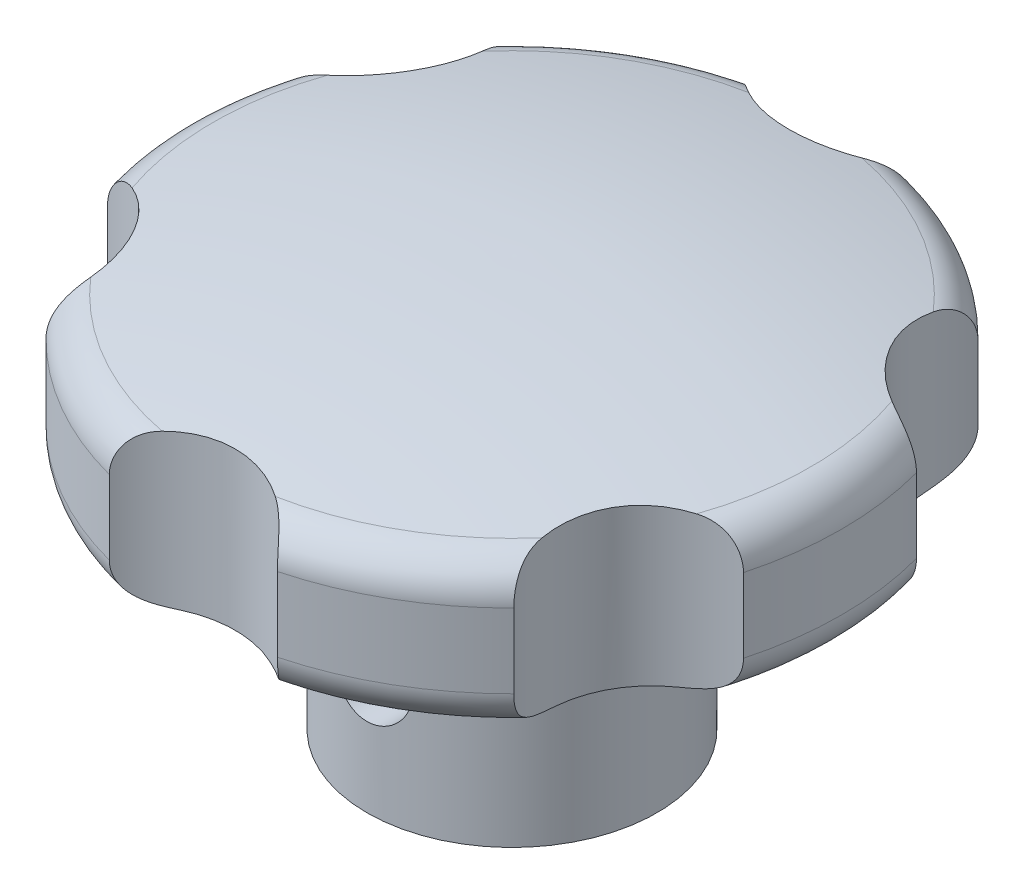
from build123d import *

# Parameters (mm, degrees)
FILLET_1_R               = 3
SKETCH_2_R               = 8
CUT_EXTRUDE_1_DEPTH      = 40.230091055
PATTERN_CIRCULAR_1_COUNT = 6
F_10_0MM_1_D             = 10
F_10_0MM_1_DEPTH         = 18
F_10_0MM_1_TIP           = 3.004303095
SKETCH_8_R               = 3
CUT_EXTRUDE_3_DEPTH      = 11
PATTERN_CIRCULAR_3_COUNT = 2
PATTERN_CIRCULAR_3_ANGLE = 120


with BuildPart() as part:
    # Sketch 1 → Revolve 1 (revolve)
    with BuildSketch(Plane(origin=(0, 0, 0), x_dir=(0, 0, -1), z_dir=(1, 0, 0))):
        with BuildLine():
            Line((0, 0), (11, 0))
            Line((11, 0), (11, 17))
            Line((11, 17), (25, 17))
            Line((25, 17), (25, 28))
            ThreePointArc((25, 28), (12.594799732, 30.289997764), (0, 31))
            Line((0, 31), (0, 0))
        make_face()
    revolve(axis=Axis((0, 0, 0), (0, 1, 0)))

    # Fillet 1
    fillet_1_edges = [part.edges().sort_by_distance(p)[0] for p in [
        (0, 17, 11),
        (0, 17, 25),
        (0, 28, 25),
    ]]
    fillet(fillet_1_edges, radius=FILLET_1_R)

    # Sketch 2 → Cut-Extrude 1 (cut, through all)
    with BuildSketch(Plane.XZ.offset(-17)):
        with Locations((0, 29)):
            Circle(SKETCH_2_R)
    cut_extrude_1 = extrude(amount=-CUT_EXTRUDE_1_DEPTH, mode=Mode.SUBTRACT)

    # Pattern Circular 1: Cut-Extrude 1 ×6 about axis
    pattern_circular_1_axis = Axis((0, 0, 0), (0, 1, 0))
    for i in range(1, PATTERN_CIRCULAR_1_COUNT):
        add(cut_extrude_1.rotate(pattern_circular_1_axis, i * 360 / PATTERN_CIRCULAR_1_COUNT), mode=Mode.SUBTRACT)

    # 10.0mm _1
    with Locations(Plane(origin=(0, 0, 0), x_dir=(-1, 0, 0), z_dir=(0, -1, 0))):
        with Locations((0, 0)):
            Hole(F_10_0MM_1_D / 2, depth=F_10_0MM_1_DEPTH)
            with Locations((0, 0, -(F_10_0MM_1_DEPTH + F_10_0MM_1_TIP / 2))):  # 118° drill point
                Cone(0, F_10_0MM_1_D / 2, F_10_0MM_1_TIP, mode=Mode.SUBTRACT)

    # Sketch 8 → Cut-Extrude 3 (cut)
    with BuildSketch(Plane.XY):
        with Locations(Location((0, 9, 0), (0, 0, 180))):
            Circle(SKETCH_8_R)
    cut_extrude_3 = extrude(amount=CUT_EXTRUDE_3_DEPTH, mode=Mode.SUBTRACT)

    # Pattern Circular 3: Cut-Extrude 3 ×2 about axis
    pattern_circular_3_axis = Axis((0, 0, 0), (0, 1, 0))
    for i in range(1, PATTERN_CIRCULAR_3_COUNT):
        add(cut_extrude_3.rotate(pattern_circular_3_axis, i * PATTERN_CIRCULAR_3_ANGLE / (PATTERN_CIRCULAR_3_COUNT - 1)), mode=Mode.SUBTRACT)


solid = part.part
